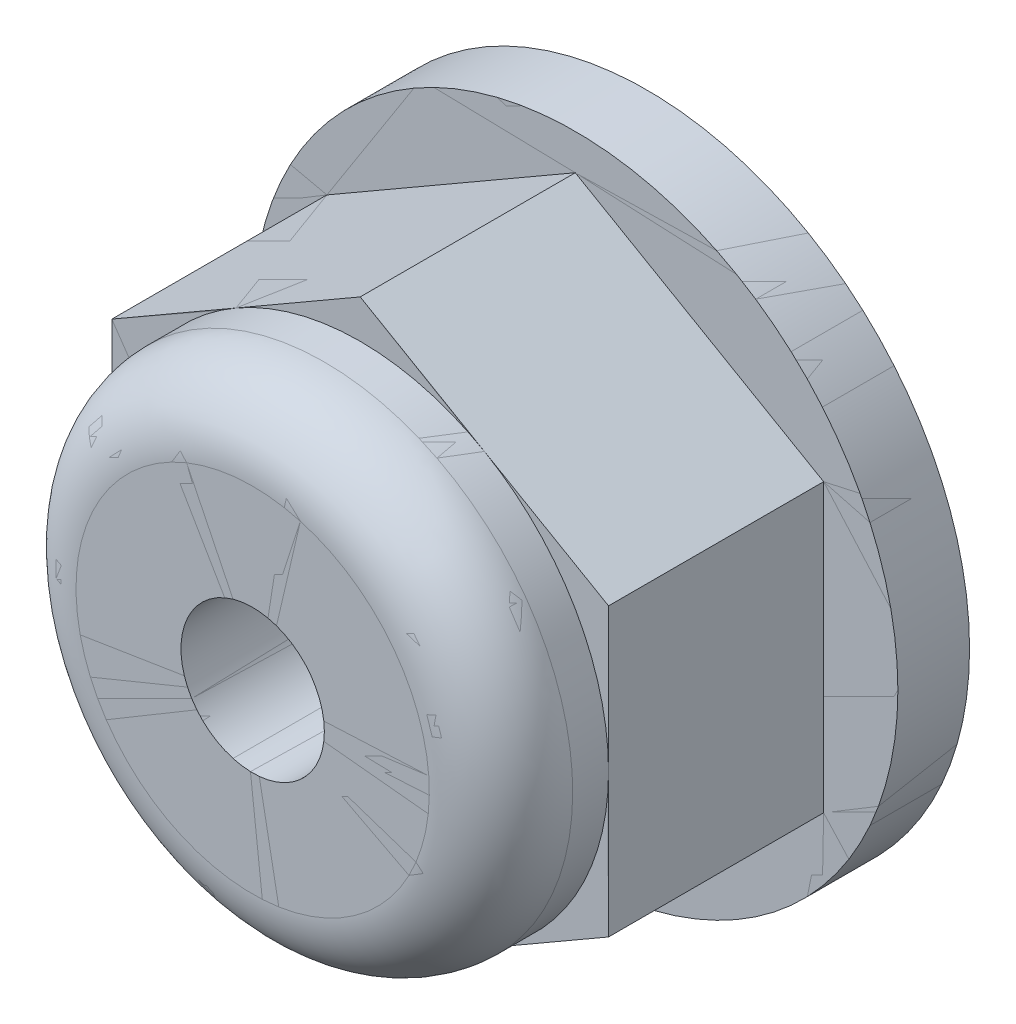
ISO-10303-21;
HEADER;
FILE_DESCRIPTION(('STEP AP214'),'2;1');
FILE_NAME('part.step','',(''),(''),'','','');
FILE_SCHEMA(('AUTOMOTIVE_DESIGN { 1 0 10303 214 1 1 1 1 }'));
ENDSEC;
DATA;
#1=APPLICATION_CONTEXT('core data for automotive mechanical design processes');
#2=APPLICATION_PROTOCOL_DEFINITION('international standard','automotive_design',2000,#1);
#3=PRODUCT_CONTEXT('',#1,'mechanical');
#4=PRODUCT('Part','Part','',(#3));
#5=PRODUCT_RELATED_PRODUCT_CATEGORY('part','',(#4));
#6=PRODUCT_DEFINITION_FORMATION('','',#4);
#7=PRODUCT_DEFINITION_CONTEXT('part definition',#1,'design');
#8=PRODUCT_DEFINITION('design','',#6,#7);
#9=PRODUCT_DEFINITION_SHAPE('','',#8);
#10=(LENGTH_UNIT() NAMED_UNIT(*) SI_UNIT(.MILLI.,.METRE.));
#11=(NAMED_UNIT(*) PLANE_ANGLE_UNIT() SI_UNIT($,.RADIAN.));
#12=(NAMED_UNIT(*) SI_UNIT($,.STERADIAN.) SOLID_ANGLE_UNIT());
#13=UNCERTAINTY_MEASURE_WITH_UNIT(LENGTH_MEASURE(1.E-05),#10,'distance_accuracy_value','');
#14=(GEOMETRIC_REPRESENTATION_CONTEXT(3) GLOBAL_UNCERTAINTY_ASSIGNED_CONTEXT((#13)) GLOBAL_UNIT_ASSIGNED_CONTEXT((#10,
#11,#12)) REPRESENTATION_CONTEXT('',''));
#15=CARTESIAN_POINT('',(0.,0.,0.));
#16=DIRECTION('',(0.,0.,1.));
#17=DIRECTION('',(1.,0.,0.));
#18=AXIS2_PLACEMENT_3D('',#15,#16,#17);
#19=CARTESIAN_POINT('',(-3.36602540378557,-3.36602540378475,4.5));
#20=DIRECTION('',(0.,0.,1.));
#21=DIRECTION('',(1.,0.,0.));
#22=AXIS2_PLACEMENT_3D('',#19,#20,#21);
#23=PLANE('',#22);
#24=CARTESIAN_POINT('',(-4.5026916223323E-13,2.6068036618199E-13,4.5));
#25=DIRECTION('',(0.,0.,1.));
#26=DIRECTION('',(1.,0.,0.));
#27=AXIS2_PLACEMENT_3D('',#24,#25,#26);
#28=CIRCLE('',#27,1.);
#29=CARTESIAN_POINT('',(0.99999999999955,2.6068036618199E-13,4.5));
#30=VERTEX_POINT('',#29);
#31=EDGE_CURVE('P0_E548',#30,#30,#28,.T.);
#32=ORIENTED_EDGE('',*,*,#31,.F.);
#33=EDGE_LOOP('',(#32));
#34=FACE_BOUND('',#33,.T.);
#35=CARTESIAN_POINT('',(-4.5030645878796E-13,2.6068036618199E-13,4.5));
#36=DIRECTION('',(0.,0.,-1.));
#37=DIRECTION('',(0.500000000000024,-0.866025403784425,0.));
#38=AXIS2_PLACEMENT_3D('',#35,#36,#37);
#39=CIRCLE('',#38,2.46410161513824);
#40=CARTESIAN_POINT('',(1.23205080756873,-2.13397459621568,4.5));
#41=VERTEX_POINT('',#40);
#42=EDGE_CURVE('P0_E518',#41,#41,#39,.T.);
#43=ORIENTED_EDGE('',*,*,#42,.F.);
#44=EDGE_LOOP('',(#43));
#45=FACE_BOUND('',#44,.T.);
#46=ADVANCED_FACE('P0_F350',(#34,#45),#23,.T.);
#47=CARTESIAN_POINT('',(1.2320508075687,-2.1339745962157,4.5));
#48=CARTESIAN_POINT('',(1.7320508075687,-3.0000000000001,4.5));
#49=CARTESIAN_POINT('',(1.7320508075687,-3.0000000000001,3.5));
#50=CARTESIAN_POINT('',(1.7320508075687,-3.0000000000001,2.5));
#51=CARTESIAN_POINT('',(1.2320508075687,-2.1339745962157,2.5));
#52=CARTESIAN_POINT('',(0.73205080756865,-1.2679491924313,2.5));
#53=CARTESIAN_POINT('',(0.73205080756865,-1.2679491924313,3.5));
#54=CARTESIAN_POINT('',(0.73205080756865,-1.2679491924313,4.5));
#55=CARTESIAN_POINT('',(1.2320508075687,-2.1339745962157,4.5));
#56=(BOUNDED_CURVE() B_SPLINE_CURVE(2,(#47,#48,#49,#50,#51,#52,#53,#54,#55),.UNSPECIFIED.,.T.,
.F.) B_SPLINE_CURVE_WITH_KNOTS((3,2,2,2,3),(0.,0.25,0.5,0.75,1.),
.UNSPECIFIED.) CURVE() GEOMETRIC_REPRESENTATION_ITEM() RATIONAL_B_SPLINE_CURVE((1.,
0.70710678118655,1.,0.70710678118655,1.,0.70710678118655,1.,0.70710678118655,1.)) REPRESENTATION_ITEM(''));
#57=CARTESIAN_POINT('',(-4.5030645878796E-13,2.6068036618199E-13,2.5));
#58=DIRECTION('',(0.,0.,1.));
#59=AXIS1_PLACEMENT('',#57,#58);
#60=SURFACE_OF_REVOLUTION('',#56,#59);
#61=CARTESIAN_POINT('',(-4.5038809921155E-13,2.6068036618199E-13,3.5));
#62=DIRECTION('',(0.,0.,1.));
#63=DIRECTION('',(0.500000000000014,-0.86602540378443,0.));
#64=AXIS2_PLACEMENT_3D('',#61,#62,#63);
#65=CIRCLE('',#64,3.4641016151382);
#66=CARTESIAN_POINT('',(1.7320508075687,-3.0000000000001,3.5));
#67=VERTEX_POINT('',#66);
#68=EDGE_CURVE('P0_E541',#67,#67,#65,.T.);
#69=ORIENTED_EDGE('',*,*,#68,.T.);
#70=EDGE_LOOP('',(#69));
#71=FACE_BOUND('',#70,.T.);
#72=ORIENTED_EDGE('',*,*,#42,.T.);
#73=EDGE_LOOP('',(#72));
#74=FACE_BOUND('',#73,.T.);
#75=ADVANCED_FACE('P0_F524',(#71,#74),#60,.F.);
#76=CARTESIAN_POINT('',(-4.5026916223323E-13,2.6068036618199E-13,-1.));
#77=DIRECTION('',(0.,0.,1.));
#78=DIRECTION('',(1.,0.,0.));
#79=AXIS2_PLACEMENT_3D('',#76,#77,#78);
#80=CYLINDRICAL_SURFACE('',#79,1.);
#81=CARTESIAN_POINT('',(-4.5026916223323E-13,2.6068036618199E-13,-1.));
#82=DIRECTION('',(0.,0.,1.));
#83=DIRECTION('',(1.,0.,0.));
#84=AXIS2_PLACEMENT_3D('',#81,#82,#83);
#85=CIRCLE('',#84,1.);
#86=CARTESIAN_POINT('',(0.99999999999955,2.6068036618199E-13,-1.));
#87=VERTEX_POINT('',#86);
#88=EDGE_CURVE('P0_E547',#87,#87,#85,.T.);
#89=ORIENTED_EDGE('',*,*,#88,.F.);
#90=EDGE_LOOP('',(#89));
#91=FACE_BOUND('',#90,.T.);
#92=ORIENTED_EDGE('',*,*,#31,.T.);
#93=EDGE_LOOP('',(#92));
#94=FACE_BOUND('',#93,.T.);
#95=ADVANCED_FACE('P0_F534',(#91,#94),#80,.F.);
#96=CARTESIAN_POINT('',(-4.50377582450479E-13,2.60642202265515E-13,3.));
#97=DIRECTION('',(0.,0.,1.));
#98=DIRECTION('',(1.,0.,0.));
#99=AXIS2_PLACEMENT_3D('',#96,#97,#98);
#100=CYLINDRICAL_SURFACE('',#99,3.4641016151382);
#101=CARTESIAN_POINT('',(-4.50377582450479E-13,2.60642202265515E-13,3.));
#102=DIRECTION('',(0.,0.,1.));
#103=DIRECTION('',(1.,0.,0.));
#104=AXIS2_PLACEMENT_3D('',#101,#102,#103);
#105=CIRCLE('',#104,3.4641016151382);
#106=CARTESIAN_POINT('',(1.73205080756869,-3.00000000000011,3.));
#107=VERTEX_POINT('',#106);
#108=CARTESIAN_POINT('',(-1.73205080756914,-3.00000000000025,3.));
#109=VERTEX_POINT('',#108);
#110=EDGE_CURVE('P0_E577',#107,#109,#105,.F.);
#111=ORIENTED_EDGE('',*,*,#110,.F.);
#112=CARTESIAN_POINT('',(-4.50377582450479E-13,2.60642202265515E-13,3.));
#113=DIRECTION('',(0.,0.,1.));
#114=DIRECTION('',(1.,0.,0.));
#115=AXIS2_PLACEMENT_3D('',#112,#113,#114);
#116=CIRCLE('',#115,3.4641016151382);
#117=CARTESIAN_POINT('',(3.46410161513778,2.92523759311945E-13,3.));
#118=VERTEX_POINT('',#117);
#119=EDGE_CURVE('P0_E580',#118,#107,#116,.F.);
#120=ORIENTED_EDGE('',*,*,#119,.F.);
#121=CARTESIAN_POINT('',(-4.50377582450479E-13,2.60642202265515E-13,3.));
#122=DIRECTION('',(0.,0.,1.));
#123=DIRECTION('',(1.,0.,0.));
#124=AXIS2_PLACEMENT_3D('',#121,#122,#123);
#125=CIRCLE('',#124,3.4641016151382);
#126=CARTESIAN_POINT('',(1.73205080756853,3.00000000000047,3.));
#127=VERTEX_POINT('',#126);
#128=EDGE_CURVE('P0_E583',#127,#118,#125,.F.);
#129=ORIENTED_EDGE('',*,*,#128,.F.);
#130=CARTESIAN_POINT('',(-4.50377582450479E-13,2.60642202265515E-13,3.));
#131=DIRECTION('',(0.,0.,1.));
#132=DIRECTION('',(1.,0.,0.));
#133=AXIS2_PLACEMENT_3D('',#130,#131,#132);
#134=CIRCLE('',#133,3.4641016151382);
#135=CARTESIAN_POINT('',(-1.73205080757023,3.00000000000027,3.));
#136=VERTEX_POINT('',#135);
#137=EDGE_CURVE('P0_E410',#136,#127,#134,.F.);
#138=ORIENTED_EDGE('',*,*,#137,.F.);
#139=CARTESIAN_POINT('',(-4.50377582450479E-13,2.60642202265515E-13,3.));
#140=DIRECTION('',(0.,0.,1.));
#141=DIRECTION('',(1.,0.,0.));
#142=AXIS2_PLACEMENT_3D('',#139,#140,#141);
#143=CIRCLE('',#142,3.4641016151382);
#144=CARTESIAN_POINT('',(-3.46410161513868,2.17779946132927E-13,3.));
#145=VERTEX_POINT('',#144);
#146=EDGE_CURVE('P0_E566',#145,#136,#143,.F.);
#147=ORIENTED_EDGE('',*,*,#146,.F.);
#148=CARTESIAN_POINT('',(-4.50377582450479E-13,2.60642202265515E-13,3.));
#149=DIRECTION('',(0.,0.,1.));
#150=DIRECTION('',(1.,0.,0.));
#151=AXIS2_PLACEMENT_3D('',#148,#149,#150);
#152=CIRCLE('',#151,3.4641016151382);
#153=EDGE_CURVE('P0_E434',#109,#145,#152,.F.);
#154=ORIENTED_EDGE('',*,*,#153,.F.);
#155=EDGE_LOOP('',(#111,#120,#129,#138,#147,#154));
#156=FACE_BOUND('',#155,.T.);
#157=ORIENTED_EDGE('',*,*,#68,.F.);
#158=EDGE_LOOP('',(#157));
#159=FACE_BOUND('',#158,.T.);
#160=ADVANCED_FACE('P0_F624',(#156,#159),#100,.T.);
#161=CARTESIAN_POINT('',(4.5,-4.5,-1.));
#162=DIRECTION('',(0.,0.,-1.));
#163=DIRECTION('',(-1.,0.,0.));
#164=AXIS2_PLACEMENT_3D('',#161,#162,#163);
#165=PLANE('',#164);
#166=ORIENTED_EDGE('',*,*,#88,.T.);
#167=EDGE_LOOP('',(#166));
#168=FACE_BOUND('',#167,.T.);
#169=CARTESIAN_POINT('',(0.,0.,-1.));
#170=DIRECTION('',(0.,0.,1.));
#171=DIRECTION('',(1.,0.,0.));
#172=AXIS2_PLACEMENT_3D('',#169,#170,#171);
#173=CIRCLE('',#172,4.5);
#174=CARTESIAN_POINT('',(4.5,0.,-1.));
#175=VERTEX_POINT('',#174);
#176=EDGE_CURVE('P0_E560',#175,#175,#173,.F.);
#177=ORIENTED_EDGE('',*,*,#176,.T.);
#178=EDGE_LOOP('',(#177));
#179=FACE_BOUND('',#178,.T.);
#180=ADVANCED_FACE('P0_F626',(#168,#179),#165,.T.);
#181=CARTESIAN_POINT('',(-3.4641016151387,-4.,3.));
#182=DIRECTION('',(0.,0.,1.));
#183=DIRECTION('',(1.,0.,0.));
#184=AXIS2_PLACEMENT_3D('',#181,#182,#183);
#185=PLANE('',#184);
#186=ORIENTED_EDGE('',*,*,#137,.T.);
#187=DIRECTION('',(0.866025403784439,-0.499999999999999,0.));
#188=VECTOR('',#187,1.);
#189=CARTESIAN_POINT('',(1.73205080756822,3.0000000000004,3.));
#190=LINE('',#189,#188);
#191=CARTESIAN_POINT('',(-6.68026278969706E-10,3.9999999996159,3.));
#192=VERTEX_POINT('',#191);
#193=EDGE_CURVE('P0_E416',#192,#127,#190,.T.);
#194=ORIENTED_EDGE('',*,*,#193,.F.);
#195=DIRECTION('',(0.866025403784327,0.500000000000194,0.));
#196=VECTOR('',#195,1.);
#197=CARTESIAN_POINT('',(-1.73205080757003,3.0000000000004,3.));
#198=LINE('',#197,#196);
#199=EDGE_CURVE('P0_E503',#136,#192,#198,.T.);
#200=ORIENTED_EDGE('',*,*,#199,.F.);
#201=EDGE_LOOP('',(#186,#194,#200));
#202=FACE_BOUND('',#201,.T.);
#203=ADVANCED_FACE('P0_F631',(#202),#185,.T.);
#204=CARTESIAN_POINT('',(-3.4641016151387,-4.,3.));
#205=DIRECTION('',(0.,0.,1.));
#206=DIRECTION('',(1.,0.,0.));
#207=AXIS2_PLACEMENT_3D('',#204,#205,#206);
#208=PLANE('',#207);
#209=DIRECTION('',(0.866025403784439,-0.499999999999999,0.));
#210=VECTOR('',#209,1.);
#211=CARTESIAN_POINT('',(1.73205080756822,3.0000000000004,3.));
#212=LINE('',#211,#210);
#213=CARTESIAN_POINT('',(3.46410161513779,2.,3.));
#214=VERTEX_POINT('',#213);
#215=EDGE_CURVE('P0_E493',#127,#214,#212,.T.);
#216=ORIENTED_EDGE('',*,*,#215,.F.);
#217=ORIENTED_EDGE('',*,*,#128,.T.);
#218=DIRECTION('',(0.,-1.,0.));
#219=VECTOR('',#218,1.);
#220=CARTESIAN_POINT('',(3.4641016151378,0.,3.));
#221=LINE('',#220,#219);
#222=EDGE_CURVE('P0_E481',#214,#118,#221,.T.);
#223=ORIENTED_EDGE('',*,*,#222,.F.);
#224=EDGE_LOOP('',(#216,#217,#223));
#225=FACE_BOUND('',#224,.T.);
#226=ADVANCED_FACE('P0_F654',(#225),#208,.T.);
#227=CARTESIAN_POINT('',(-3.4641016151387,-4.,3.));
#228=DIRECTION('',(0.,0.,1.));
#229=DIRECTION('',(1.,0.,0.));
#230=AXIS2_PLACEMENT_3D('',#227,#228,#229);
#231=PLANE('',#230);
#232=DIRECTION('',(0.,-1.,0.));
#233=VECTOR('',#232,1.);
#234=CARTESIAN_POINT('',(3.4641016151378,0.,3.));
#235=LINE('',#234,#233);
#236=CARTESIAN_POINT('',(3.4641016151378,-1.99999999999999,3.));
#237=VERTEX_POINT('',#236);
#238=EDGE_CURVE('P0_E478',#118,#237,#235,.T.);
#239=ORIENTED_EDGE('',*,*,#238,.F.);
#240=ORIENTED_EDGE('',*,*,#119,.T.);
#241=DIRECTION('',(-0.866025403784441,-0.499999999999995,0.));
#242=VECTOR('',#241,1.);
#243=CARTESIAN_POINT('',(1.7320508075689,-3.,3.));
#244=LINE('',#243,#242);
#245=EDGE_CURVE('P0_E467',#237,#107,#244,.T.);
#246=ORIENTED_EDGE('',*,*,#245,.F.);
#247=EDGE_LOOP('',(#239,#240,#246));
#248=FACE_BOUND('',#247,.T.);
#249=ADVANCED_FACE('P0_F640',(#248),#231,.T.);
#250=CARTESIAN_POINT('',(-3.4641016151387,-4.,3.));
#251=DIRECTION('',(0.,0.,1.));
#252=DIRECTION('',(1.,0.,0.));
#253=AXIS2_PLACEMENT_3D('',#250,#251,#252);
#254=PLANE('',#253);
#255=DIRECTION('',(-0.866025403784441,-0.499999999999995,0.));
#256=VECTOR('',#255,1.);
#257=CARTESIAN_POINT('',(1.7320508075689,-3.,3.));
#258=LINE('',#257,#256);
#259=CARTESIAN_POINT('',(6.66662760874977E-10,-3.9999999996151,3.));
#260=VERTEX_POINT('',#259);
#261=EDGE_CURVE('P0_E464',#107,#260,#258,.T.);
#262=ORIENTED_EDGE('',*,*,#261,.F.);
#263=ORIENTED_EDGE('',*,*,#110,.T.);
#264=DIRECTION('',(-0.866025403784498,0.499999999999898,0.));
#265=VECTOR('',#264,1.);
#266=CARTESIAN_POINT('',(-1.73205080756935,-3.,3.));
#267=LINE('',#266,#265);
#268=EDGE_CURVE('P0_E443',#260,#109,#267,.T.);
#269=ORIENTED_EDGE('',*,*,#268,.F.);
#270=EDGE_LOOP('',(#262,#263,#269));
#271=FACE_BOUND('',#270,.T.);
#272=ADVANCED_FACE('P0_F641',(#271),#254,.T.);
#273=CARTESIAN_POINT('',(-3.4641016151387,-4.,3.));
#274=DIRECTION('',(0.,0.,1.));
#275=DIRECTION('',(1.,0.,0.));
#276=AXIS2_PLACEMENT_3D('',#273,#274,#275);
#277=PLANE('',#276);
#278=DIRECTION('',(-0.866025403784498,0.499999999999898,0.));
#279=VECTOR('',#278,1.);
#280=CARTESIAN_POINT('',(-1.73205080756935,-3.,3.));
#281=LINE('',#280,#279);
#282=CARTESIAN_POINT('',(-3.4641016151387,-2.,3.));
#283=VERTEX_POINT('',#282);
#284=EDGE_CURVE('P0_E432',#109,#283,#281,.T.);
#285=ORIENTED_EDGE('',*,*,#284,.F.);
#286=ORIENTED_EDGE('',*,*,#153,.T.);
#287=DIRECTION('',(0.,1.,0.));
#288=VECTOR('',#287,1.);
#289=CARTESIAN_POINT('',(-3.4641016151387,0.,3.));
#290=LINE('',#289,#288);
#291=EDGE_CURVE('P0_E430',#283,#145,#290,.T.);
#292=ORIENTED_EDGE('',*,*,#291,.F.);
#293=EDGE_LOOP('',(#285,#286,#292));
#294=FACE_BOUND('',#293,.T.);
#295=ADVANCED_FACE('P0_F431',(#294),#277,.T.);
#296=CARTESIAN_POINT('',(-3.4641016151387,-4.,3.));
#297=DIRECTION('',(0.,0.,1.));
#298=DIRECTION('',(1.,0.,0.));
#299=AXIS2_PLACEMENT_3D('',#296,#297,#298);
#300=PLANE('',#299);
#301=DIRECTION('',(0.,1.,0.));
#302=VECTOR('',#301,1.);
#303=CARTESIAN_POINT('',(-3.4641016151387,0.,3.));
#304=LINE('',#303,#302);
#305=CARTESIAN_POINT('',(-3.4641016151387,2.,3.));
#306=VERTEX_POINT('',#305);
#307=EDGE_CURVE('P0_E438',#145,#306,#304,.T.);
#308=ORIENTED_EDGE('',*,*,#307,.F.);
#309=ORIENTED_EDGE('',*,*,#146,.T.);
#310=DIRECTION('',(0.866025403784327,0.500000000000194,0.));
#311=VECTOR('',#310,1.);
#312=CARTESIAN_POINT('',(-1.73205080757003,3.0000000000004,3.));
#313=LINE('',#312,#311);
#314=EDGE_CURVE('P0_E507',#306,#136,#313,.T.);
#315=ORIENTED_EDGE('',*,*,#314,.F.);
#316=EDGE_LOOP('',(#308,#309,#315));
#317=FACE_BOUND('',#316,.T.);
#318=ADVANCED_FACE('P0_F614',(#317),#300,.T.);
#319=CARTESIAN_POINT('',(0.,0.,-1.));
#320=DIRECTION('',(0.,0.,1.));
#321=DIRECTION('',(1.,0.,0.));
#322=AXIS2_PLACEMENT_3D('',#319,#320,#321);
#323=CYLINDRICAL_SURFACE('',#322,4.5);
#324=ORIENTED_EDGE('',*,*,#176,.F.);
#325=EDGE_LOOP('',(#324));
#326=FACE_BOUND('',#325,.T.);
#327=CARTESIAN_POINT('',(0.,0.,0.));
#328=DIRECTION('',(0.,0.,1.));
#329=DIRECTION('',(1.,0.,0.));
#330=AXIS2_PLACEMENT_3D('',#327,#328,#329);
#331=CIRCLE('',#330,4.5);
#332=CARTESIAN_POINT('',(4.5,0.,0.));
#333=VERTEX_POINT('',#332);
#334=EDGE_CURVE('P0_E448',#333,#333,#331,.T.);
#335=ORIENTED_EDGE('',*,*,#334,.F.);
#336=EDGE_LOOP('',(#335));
#337=FACE_BOUND('',#336,.T.);
#338=ADVANCED_FACE('P0_F611',(#326,#337),#323,.T.);
#339=CARTESIAN_POINT('',(-1.3531855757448E-12,4.0000000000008,3.));
#340=DIRECTION('',(-0.500000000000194,0.866025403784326,0.));
#341=DIRECTION('',(0.,0.,-1.));
#342=AXIS2_PLACEMENT_3D('',#339,#340,#341);
#343=PLANE('',#342);
#344=DIRECTION('',(0.866025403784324,0.500000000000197,0.));
#345=VECTOR('',#344,1.);
#346=CARTESIAN_POINT('',(-3.46410161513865,1.99999999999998,0.));
#347=LINE('',#346,#345);
#348=CARTESIAN_POINT('',(-3.46410161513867,1.99999999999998,0.));
#349=VERTEX_POINT('',#348);
#350=CARTESIAN_POINT('',(-1.3547151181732E-12,4.00000000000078,0.));
#351=VERTEX_POINT('',#350);
#352=EDGE_CURVE('P0_E452',#349,#351,#347,.T.);
#353=ORIENTED_EDGE('',*,*,#352,.F.);
#354=DIRECTION('',(0.,0.,-1.));
#355=VECTOR('',#354,1.);
#356=CARTESIAN_POINT('',(-3.4641016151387,2.,1.));
#357=LINE('',#356,#355);
#358=EDGE_CURVE('P0_E449',#306,#349,#357,.T.);
#359=ORIENTED_EDGE('',*,*,#358,.F.);
#360=ORIENTED_EDGE('',*,*,#314,.T.);
#361=ORIENTED_EDGE('',*,*,#199,.T.);
#362=DIRECTION('',(0.,0.,1.));
#363=VECTOR('',#362,1.);
#364=CARTESIAN_POINT('',(-1.3540280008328E-12,4.0000000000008,0.9999999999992));
#365=LINE('',#364,#363);
#366=EDGE_CURVE('P0_E490',#351,#192,#365,.T.);
#367=ORIENTED_EDGE('',*,*,#366,.F.);
#368=EDGE_LOOP('',(#353,#359,#360,#361,#367));
#369=FACE_BOUND('',#368,.T.);
#370=ADVANCED_FACE('P0_F613',(#369),#343,.T.);
#371=CARTESIAN_POINT('',(3.4641016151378,2.,3.));
#372=DIRECTION('',(0.499999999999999,0.866025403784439,0.));
#373=DIRECTION('',(0.,0.,-1.));
#374=AXIS2_PLACEMENT_3D('',#371,#372,#373);
#375=PLANE('',#374);
#376=DIRECTION('',(0.866025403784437,-0.500000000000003,0.));
#377=VECTOR('',#376,1.);
#378=CARTESIAN_POINT('',(-1.34874750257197E-12,4.00000000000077,0.));
#379=LINE('',#378,#377);
#380=CARTESIAN_POINT('',(3.46410161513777,1.99999999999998,0.));
#381=VERTEX_POINT('',#380);
#382=EDGE_CURVE('P0_E657',#351,#381,#379,.T.);
#383=ORIENTED_EDGE('',*,*,#382,.F.);
#384=ORIENTED_EDGE('',*,*,#366,.T.);
#385=ORIENTED_EDGE('',*,*,#193,.T.);
#386=ORIENTED_EDGE('',*,*,#215,.T.);
#387=DIRECTION('',(0.,0.,1.));
#388=VECTOR('',#387,1.);
#389=CARTESIAN_POINT('',(3.4641016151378,2.,1.));
#390=LINE('',#389,#388);
#391=EDGE_CURVE('P0_E475',#381,#214,#390,.T.);
#392=ORIENTED_EDGE('',*,*,#391,.F.);
#393=EDGE_LOOP('',(#383,#384,#385,#386,#392));
#394=FACE_BOUND('',#393,.T.);
#395=ADVANCED_FACE('P0_F620',(#394),#375,.T.);
#396=CARTESIAN_POINT('',(3.4641016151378,-2.,3.));
#397=DIRECTION('',(1.,0.,0.));
#398=DIRECTION('',(0.,0.,-1.));
#399=AXIS2_PLACEMENT_3D('',#396,#397,#398);
#400=PLANE('',#399);
#401=DIRECTION('',(0.,-1.,0.));
#402=VECTOR('',#401,1.);
#403=CARTESIAN_POINT('',(3.46410161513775,0.,0.));
#404=LINE('',#403,#402);
#405=CARTESIAN_POINT('',(3.46410161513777,-1.99999999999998,0.));
#406=VERTEX_POINT('',#405);
#407=EDGE_CURVE('P0_E650',#381,#406,#404,.T.);
#408=ORIENTED_EDGE('',*,*,#407,.F.);
#409=ORIENTED_EDGE('',*,*,#391,.T.);
#410=ORIENTED_EDGE('',*,*,#222,.T.);
#411=ORIENTED_EDGE('',*,*,#238,.T.);
#412=DIRECTION('',(0.,0.,1.));
#413=VECTOR('',#412,1.);
#414=CARTESIAN_POINT('',(3.4641016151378,-2.,1.));
#415=LINE('',#414,#413);
#416=EDGE_CURVE('P0_E461',#406,#237,#415,.T.);
#417=ORIENTED_EDGE('',*,*,#416,.F.);
#418=EDGE_LOOP('',(#408,#409,#410,#411,#417));
#419=FACE_BOUND('',#418,.T.);
#420=ADVANCED_FACE('P0_F649',(#419),#400,.T.);
#421=CARTESIAN_POINT('',(0.,-4.,3.));
#422=DIRECTION('',(0.499999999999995,-0.866025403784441,0.));
#423=DIRECTION('',(0.,0.,-1.));
#424=AXIS2_PLACEMENT_3D('',#421,#422,#423);
#425=PLANE('',#424);
#426=DIRECTION('',(-0.866025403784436,-0.500000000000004,0.));
#427=VECTOR('',#426,1.);
#428=CARTESIAN_POINT('',(3.46410161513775,-1.99999999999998,0.));
#429=LINE('',#428,#427);
#430=CARTESIAN_POINT('',(0.,-4.,0.));
#431=VERTEX_POINT('',#430);
#432=EDGE_CURVE('P0_E645',#406,#431,#429,.T.);
#433=ORIENTED_EDGE('',*,*,#432,.F.);
#434=ORIENTED_EDGE('',*,*,#416,.T.);
#435=ORIENTED_EDGE('',*,*,#245,.T.);
#436=ORIENTED_EDGE('',*,*,#261,.T.);
#437=DIRECTION('',(0.,0.,1.));
#438=VECTOR('',#437,1.);
#439=CARTESIAN_POINT('',(0.,-4.,0.9999999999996));
#440=LINE('',#439,#438);
#441=EDGE_CURVE('P0_E439',#431,#260,#440,.T.);
#442=ORIENTED_EDGE('',*,*,#441,.F.);
#443=EDGE_LOOP('',(#433,#434,#435,#436,#442));
#444=FACE_BOUND('',#443,.T.);
#445=ADVANCED_FACE('P0_F644',(#444),#425,.T.);
#446=CARTESIAN_POINT('',(-3.4641016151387,-2.,3.));
#447=DIRECTION('',(-0.499999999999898,-0.866025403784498,0.));
#448=DIRECTION('',(0.,0.,-1.));
#449=AXIS2_PLACEMENT_3D('',#446,#447,#448);
#450=PLANE('',#449);
#451=DIRECTION('',(-0.866025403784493,0.499999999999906,0.));
#452=VECTOR('',#451,1.);
#453=CARTESIAN_POINT('',(0.,-4.,0.));
#454=LINE('',#453,#452);
#455=CARTESIAN_POINT('',(-3.46410161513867,-1.99999999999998,0.));
#456=VERTEX_POINT('',#455);
#457=EDGE_CURVE('P0_E360',#431,#456,#454,.T.);
#458=ORIENTED_EDGE('',*,*,#457,.F.);
#459=ORIENTED_EDGE('',*,*,#441,.T.);
#460=ORIENTED_EDGE('',*,*,#268,.T.);
#461=ORIENTED_EDGE('',*,*,#284,.T.);
#462=DIRECTION('',(0.,0.,1.));
#463=VECTOR('',#462,1.);
#464=CARTESIAN_POINT('',(-3.4641016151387,-2.,1.));
#465=LINE('',#464,#463);
#466=EDGE_CURVE('P0_E369',#456,#283,#465,.T.);
#467=ORIENTED_EDGE('',*,*,#466,.F.);
#468=EDGE_LOOP('',(#458,#459,#460,#461,#467));
#469=FACE_BOUND('',#468,.T.);
#470=ADVANCED_FACE('P0_F441',(#469),#450,.T.);
#471=CARTESIAN_POINT('',(-3.4641016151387,2.,3.));
#472=DIRECTION('',(-1.,0.,0.));
#473=DIRECTION('',(0.,0.,-1.));
#474=AXIS2_PLACEMENT_3D('',#471,#472,#473);
#475=PLANE('',#474);
#476=DIRECTION('',(0.,1.,0.));
#477=VECTOR('',#476,1.);
#478=CARTESIAN_POINT('',(-3.46410161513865,0.,0.));
#479=LINE('',#478,#477);
#480=EDGE_CURVE('P0_E11',#456,#349,#479,.T.);
#481=ORIENTED_EDGE('',*,*,#480,.F.);
#482=ORIENTED_EDGE('',*,*,#466,.T.);
#483=ORIENTED_EDGE('',*,*,#291,.T.);
#484=ORIENTED_EDGE('',*,*,#307,.T.);
#485=ORIENTED_EDGE('',*,*,#358,.T.);
#486=EDGE_LOOP('',(#481,#482,#483,#484,#485));
#487=FACE_BOUND('',#486,.T.);
#488=ADVANCED_FACE('P0_F445',(#487),#475,.T.);
#489=CARTESIAN_POINT('',(-4.5,-4.5,0.));
#490=DIRECTION('',(0.,0.,1.));
#491=DIRECTION('',(1.,0.,0.));
#492=AXIS2_PLACEMENT_3D('',#489,#490,#491);
#493=PLANE('',#492);
#494=ORIENTED_EDGE('',*,*,#457,.T.);
#495=ORIENTED_EDGE('',*,*,#480,.T.);
#496=ORIENTED_EDGE('',*,*,#352,.T.);
#497=ORIENTED_EDGE('',*,*,#382,.T.);
#498=ORIENTED_EDGE('',*,*,#407,.T.);
#499=ORIENTED_EDGE('',*,*,#432,.T.);
#500=EDGE_LOOP('',(#494,#495,#496,#497,#498,#499));
#501=FACE_BOUND('',#500,.T.);
#502=ORIENTED_EDGE('',*,*,#334,.T.);
#503=EDGE_LOOP('',(#502));
#504=FACE_BOUND('',#503,.T.);
#505=ADVANCED_FACE('P0_F352',(#501,#504),#493,.T.);
#506=CLOSED_SHELL('',(#46,#75,#95,#160,#180,#203,#226,#249,#272,#295,#318,#338,#370,#395,#420,
#445,#470,#488,#505));
#507=MANIFOLD_SOLID_BREP('P0_B2',#506);
#508=CARTESIAN_POINT('',(-3.36602540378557,-3.36602540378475,4.5));
#509=DIRECTION('',(0.,0.,1.));
#510=DIRECTION('',(1.,0.,0.));
#511=AXIS2_PLACEMENT_3D('',#508,#509,#510);
#512=PLANE('',#511);
#513=CARTESIAN_POINT('',(-4.5026916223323E-13,2.6068036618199E-13,4.5));
#514=DIRECTION('',(0.,0.,1.));
#515=DIRECTION('',(1.,0.,0.));
#516=AXIS2_PLACEMENT_3D('',#513,#514,#515);
#517=CIRCLE('',#516,1.);
#518=CARTESIAN_POINT('',(0.99999999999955,2.6068036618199E-13,4.5));
#519=VERTEX_POINT('',#518);
#520=EDGE_CURVE('P1_E213',#519,#519,#517,.T.);
#521=ORIENTED_EDGE('',*,*,#520,.F.);
#522=EDGE_LOOP('',(#521));
#523=FACE_BOUND('',#522,.T.);
#524=CARTESIAN_POINT('',(-4.5030645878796E-13,2.6068036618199E-13,4.5));
#525=DIRECTION('',(0.,0.,-1.));
#526=DIRECTION('',(0.500000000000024,-0.866025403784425,0.));
#527=AXIS2_PLACEMENT_3D('',#524,#525,#526);
#528=CIRCLE('',#527,2.46410161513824);
#529=CARTESIAN_POINT('',(1.23205080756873,-2.13397459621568,4.5));
#530=VERTEX_POINT('',#529);
#531=EDGE_CURVE('P1_E184',#530,#530,#528,.T.);
#532=ORIENTED_EDGE('',*,*,#531,.F.);
#533=EDGE_LOOP('',(#532));
#534=FACE_BOUND('',#533,.T.);
#535=ADVANCED_FACE('P1_F16',(#523,#534),#512,.T.);
#536=CARTESIAN_POINT('',(1.2320508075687,-2.1339745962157,4.5));
#537=CARTESIAN_POINT('',(1.7320508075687,-3.0000000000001,4.5));
#538=CARTESIAN_POINT('',(1.7320508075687,-3.0000000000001,3.5));
#539=CARTESIAN_POINT('',(1.7320508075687,-3.0000000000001,2.5));
#540=CARTESIAN_POINT('',(1.2320508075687,-2.1339745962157,2.5));
#541=CARTESIAN_POINT('',(0.73205080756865,-1.2679491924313,2.5));
#542=CARTESIAN_POINT('',(0.73205080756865,-1.2679491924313,3.5));
#543=CARTESIAN_POINT('',(0.73205080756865,-1.2679491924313,4.5));
#544=CARTESIAN_POINT('',(1.2320508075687,-2.1339745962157,4.5));
#545=(BOUNDED_CURVE() B_SPLINE_CURVE(2,(#536,#537,#538,#539,#540,#541,#542,#543,#544),
.UNSPECIFIED.,.T.,.F.) B_SPLINE_CURVE_WITH_KNOTS((3,2,2,2,3),(0.,0.25,0.5,0.75,1.),
.UNSPECIFIED.) CURVE() GEOMETRIC_REPRESENTATION_ITEM() RATIONAL_B_SPLINE_CURVE((1.,
0.70710678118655,1.,0.70710678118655,1.,0.70710678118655,1.,0.70710678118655,1.)) REPRESENTATION_ITEM(''));
#546=CARTESIAN_POINT('',(-4.5030645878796E-13,2.6068036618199E-13,2.5));
#547=DIRECTION('',(0.,0.,1.));
#548=AXIS1_PLACEMENT('',#546,#547);
#549=SURFACE_OF_REVOLUTION('',#545,#548);
#550=CARTESIAN_POINT('',(-4.5038809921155E-13,2.6068036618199E-13,3.5));
#551=DIRECTION('',(0.,0.,1.));
#552=DIRECTION('',(0.500000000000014,-0.86602540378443,0.));
#553=AXIS2_PLACEMENT_3D('',#550,#551,#552);
#554=CIRCLE('',#553,3.4641016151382);
#555=CARTESIAN_POINT('',(1.7320508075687,-3.0000000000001,3.5));
#556=VERTEX_POINT('',#555);
#557=EDGE_CURVE('P1_E206',#556,#556,#554,.T.);
#558=ORIENTED_EDGE('',*,*,#557,.T.);
#559=EDGE_LOOP('',(#558));
#560=FACE_BOUND('',#559,.T.);
#561=ORIENTED_EDGE('',*,*,#531,.T.);
#562=EDGE_LOOP('',(#561));
#563=FACE_BOUND('',#562,.T.);
#564=ADVANCED_FACE('P1_F190',(#560,#563),#549,.F.);
#565=CARTESIAN_POINT('',(-4.5026916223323E-13,2.6068036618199E-13,-1.));
#566=DIRECTION('',(0.,0.,1.));
#567=DIRECTION('',(1.,0.,0.));
#568=AXIS2_PLACEMENT_3D('',#565,#566,#567);
#569=CYLINDRICAL_SURFACE('',#568,1.);
#570=CARTESIAN_POINT('',(-4.5026916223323E-13,2.6068036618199E-13,-1.));
#571=DIRECTION('',(0.,0.,1.));
#572=DIRECTION('',(1.,0.,0.));
#573=AXIS2_PLACEMENT_3D('',#570,#571,#572);
#574=CIRCLE('',#573,1.);
#575=CARTESIAN_POINT('',(0.99999999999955,2.6068036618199E-13,-1.));
#576=VERTEX_POINT('',#575);
#577=EDGE_CURVE('P1_E212',#576,#576,#574,.T.);
#578=ORIENTED_EDGE('',*,*,#577,.F.);
#579=EDGE_LOOP('',(#578));
#580=FACE_BOUND('',#579,.T.);
#581=ORIENTED_EDGE('',*,*,#520,.T.);
#582=EDGE_LOOP('',(#581));
#583=FACE_BOUND('',#582,.T.);
#584=ADVANCED_FACE('P1_F199',(#580,#583),#569,.F.);
#585=CARTESIAN_POINT('',(-4.50377582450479E-13,2.60642202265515E-13,3.));
#586=DIRECTION('',(0.,0.,1.));
#587=DIRECTION('',(1.,0.,0.));
#588=AXIS2_PLACEMENT_3D('',#585,#586,#587);
#589=CYLINDRICAL_SURFACE('',#588,3.4641016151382);
#590=CARTESIAN_POINT('',(-4.50377582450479E-13,2.60642202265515E-13,3.));
#591=DIRECTION('',(0.,0.,1.));
#592=DIRECTION('',(1.,0.,0.));
#593=AXIS2_PLACEMENT_3D('',#590,#591,#592);
#594=CIRCLE('',#593,3.4641016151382);
#595=CARTESIAN_POINT('',(1.73205080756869,-3.00000000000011,3.));
#596=VERTEX_POINT('',#595);
#597=CARTESIAN_POINT('',(-1.73205080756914,-3.00000000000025,3.));
#598=VERTEX_POINT('',#597);
#599=EDGE_CURVE('P1_E242',#596,#598,#594,.F.);
#600=ORIENTED_EDGE('',*,*,#599,.F.);
#601=CARTESIAN_POINT('',(-4.50377582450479E-13,2.60642202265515E-13,3.));
#602=DIRECTION('',(0.,0.,1.));
#603=DIRECTION('',(1.,0.,0.));
#604=AXIS2_PLACEMENT_3D('',#601,#602,#603);
#605=CIRCLE('',#604,3.4641016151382);
#606=CARTESIAN_POINT('',(3.46410161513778,2.92523759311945E-13,3.));
#607=VERTEX_POINT('',#606);
#608=EDGE_CURVE('P1_E245',#607,#596,#605,.F.);
#609=ORIENTED_EDGE('',*,*,#608,.F.);
#610=CARTESIAN_POINT('',(-4.50377582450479E-13,2.60642202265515E-13,3.));
#611=DIRECTION('',(0.,0.,1.));
#612=DIRECTION('',(1.,0.,0.));
#613=AXIS2_PLACEMENT_3D('',#610,#611,#612);
#614=CIRCLE('',#613,3.4641016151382);
#615=CARTESIAN_POINT('',(1.73205080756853,3.00000000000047,3.));
#616=VERTEX_POINT('',#615);
#617=EDGE_CURVE('P1_E248',#616,#607,#614,.F.);
#618=ORIENTED_EDGE('',*,*,#617,.F.);
#619=CARTESIAN_POINT('',(-4.50377582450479E-13,2.60642202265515E-13,3.));
#620=DIRECTION('',(0.,0.,1.));
#621=DIRECTION('',(1.,0.,0.));
#622=AXIS2_PLACEMENT_3D('',#619,#620,#621);
#623=CIRCLE('',#622,3.4641016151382);
#624=CARTESIAN_POINT('',(-1.73205080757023,3.00000000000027,3.));
#625=VERTEX_POINT('',#624);
#626=EDGE_CURVE('P1_E76',#625,#616,#623,.F.);
#627=ORIENTED_EDGE('',*,*,#626,.F.);
#628=CARTESIAN_POINT('',(-4.50377582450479E-13,2.60642202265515E-13,3.));
#629=DIRECTION('',(0.,0.,1.));
#630=DIRECTION('',(1.,0.,0.));
#631=AXIS2_PLACEMENT_3D('',#628,#629,#630);
#632=CIRCLE('',#631,3.4641016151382);
#633=CARTESIAN_POINT('',(-3.46410161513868,2.17779946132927E-13,3.));
#634=VERTEX_POINT('',#633);
#635=EDGE_CURVE('P1_E231',#634,#625,#632,.F.);
#636=ORIENTED_EDGE('',*,*,#635,.F.);
#637=CARTESIAN_POINT('',(-4.50377582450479E-13,2.60642202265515E-13,3.));
#638=DIRECTION('',(0.,0.,1.));
#639=DIRECTION('',(1.,0.,0.));
#640=AXIS2_PLACEMENT_3D('',#637,#638,#639);
#641=CIRCLE('',#640,3.4641016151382);
#642=EDGE_CURVE('P1_E100',#598,#634,#641,.F.);
#643=ORIENTED_EDGE('',*,*,#642,.F.);
#644=EDGE_LOOP('',(#600,#609,#618,#627,#636,#643));
#645=FACE_BOUND('',#644,.T.);
#646=ORIENTED_EDGE('',*,*,#557,.F.);
#647=EDGE_LOOP('',(#646));
#648=FACE_BOUND('',#647,.T.);
#649=ADVANCED_FACE('P1_F277',(#645,#648),#589,.T.);
#650=CARTESIAN_POINT('',(4.5,-4.5,-1.));
#651=DIRECTION('',(0.,0.,-1.));
#652=DIRECTION('',(-1.,0.,0.));
#653=AXIS2_PLACEMENT_3D('',#650,#651,#652);
#654=PLANE('',#653);
#655=ORIENTED_EDGE('',*,*,#577,.T.);
#656=EDGE_LOOP('',(#655));
#657=FACE_BOUND('',#656,.T.);
#658=CARTESIAN_POINT('',(0.,0.,-1.));
#659=DIRECTION('',(0.,0.,1.));
#660=DIRECTION('',(1.,0.,0.));
#661=AXIS2_PLACEMENT_3D('',#658,#659,#660);
#662=CIRCLE('',#661,4.5);
#663=CARTESIAN_POINT('',(4.5,0.,-1.));
#664=VERTEX_POINT('',#663);
#665=EDGE_CURVE('P1_E225',#664,#664,#662,.F.);
#666=ORIENTED_EDGE('',*,*,#665,.T.);
#667=EDGE_LOOP('',(#666));
#668=FACE_BOUND('',#667,.T.);
#669=ADVANCED_FACE('P1_F278',(#657,#668),#654,.T.);
#670=CARTESIAN_POINT('',(-3.4641016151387,-4.,3.));
#671=DIRECTION('',(0.,0.,1.));
#672=DIRECTION('',(1.,0.,0.));
#673=AXIS2_PLACEMENT_3D('',#670,#671,#672);
#674=PLANE('',#673);
#675=ORIENTED_EDGE('',*,*,#626,.T.);
#676=DIRECTION('',(0.866025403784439,-0.499999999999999,0.));
#677=VECTOR('',#676,1.);
#678=CARTESIAN_POINT('',(1.73205080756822,3.0000000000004,3.));
#679=LINE('',#678,#677);
#680=CARTESIAN_POINT('',(-6.68026278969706E-10,3.9999999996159,3.));
#681=VERTEX_POINT('',#680);
#682=EDGE_CURVE('P1_E82',#681,#616,#679,.T.);
#683=ORIENTED_EDGE('',*,*,#682,.F.);
#684=DIRECTION('',(0.866025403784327,0.500000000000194,0.));
#685=VECTOR('',#684,1.);
#686=CARTESIAN_POINT('',(-1.73205080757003,3.0000000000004,3.));
#687=LINE('',#686,#685);
#688=EDGE_CURVE('P1_E169',#625,#681,#687,.T.);
#689=ORIENTED_EDGE('',*,*,#688,.F.);
#690=EDGE_LOOP('',(#675,#683,#689));
#691=FACE_BOUND('',#690,.T.);
#692=ADVANCED_FACE('P1_F279',(#691),#674,.T.);
#693=CARTESIAN_POINT('',(-3.4641016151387,-4.,3.));
#694=DIRECTION('',(0.,0.,1.));
#695=DIRECTION('',(1.,0.,0.));
#696=AXIS2_PLACEMENT_3D('',#693,#694,#695);
#697=PLANE('',#696);
#698=DIRECTION('',(0.866025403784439,-0.499999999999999,0.));
#699=VECTOR('',#698,1.);
#700=CARTESIAN_POINT('',(1.73205080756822,3.0000000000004,3.));
#701=LINE('',#700,#699);
#702=CARTESIAN_POINT('',(3.46410161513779,2.,3.));
#703=VERTEX_POINT('',#702);
#704=EDGE_CURVE('P1_E159',#616,#703,#701,.T.);
#705=ORIENTED_EDGE('',*,*,#704,.F.);
#706=ORIENTED_EDGE('',*,*,#617,.T.);
#707=DIRECTION('',(0.,-1.,0.));
#708=VECTOR('',#707,1.);
#709=CARTESIAN_POINT('',(3.4641016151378,0.,3.));
#710=LINE('',#709,#708);
#711=EDGE_CURVE('P1_E147',#703,#607,#710,.T.);
#712=ORIENTED_EDGE('',*,*,#711,.F.);
#713=EDGE_LOOP('',(#705,#706,#712));
#714=FACE_BOUND('',#713,.T.);
#715=ADVANCED_FACE('P1_F302',(#714),#697,.T.);
#716=CARTESIAN_POINT('',(-3.4641016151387,-4.,3.));
#717=DIRECTION('',(0.,0.,1.));
#718=DIRECTION('',(1.,0.,0.));
#719=AXIS2_PLACEMENT_3D('',#716,#717,#718);
#720=PLANE('',#719);
#721=DIRECTION('',(0.,-1.,0.));
#722=VECTOR('',#721,1.);
#723=CARTESIAN_POINT('',(3.4641016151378,0.,3.));
#724=LINE('',#723,#722);
#725=CARTESIAN_POINT('',(3.4641016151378,-1.99999999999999,3.));
#726=VERTEX_POINT('',#725);
#727=EDGE_CURVE('P1_E144',#607,#726,#724,.T.);
#728=ORIENTED_EDGE('',*,*,#727,.F.);
#729=ORIENTED_EDGE('',*,*,#608,.T.);
#730=DIRECTION('',(-0.866025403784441,-0.499999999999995,0.));
#731=VECTOR('',#730,1.);
#732=CARTESIAN_POINT('',(1.7320508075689,-3.,3.));
#733=LINE('',#732,#731);
#734=EDGE_CURVE('P1_E133',#726,#596,#733,.T.);
#735=ORIENTED_EDGE('',*,*,#734,.F.);
#736=EDGE_LOOP('',(#728,#729,#735));
#737=FACE_BOUND('',#736,.T.);
#738=ADVANCED_FACE('P1_F288',(#737),#720,.T.);
#739=CARTESIAN_POINT('',(-3.4641016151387,-4.,3.));
#740=DIRECTION('',(0.,0.,1.));
#741=DIRECTION('',(1.,0.,0.));
#742=AXIS2_PLACEMENT_3D('',#739,#740,#741);
#743=PLANE('',#742);
#744=DIRECTION('',(-0.866025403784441,-0.499999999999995,0.));
#745=VECTOR('',#744,1.);
#746=CARTESIAN_POINT('',(1.7320508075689,-3.,3.));
#747=LINE('',#746,#745);
#748=CARTESIAN_POINT('',(6.66662760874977E-10,-3.9999999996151,3.));
#749=VERTEX_POINT('',#748);
#750=EDGE_CURVE('P1_E130',#596,#749,#747,.T.);
#751=ORIENTED_EDGE('',*,*,#750,.F.);
#752=ORIENTED_EDGE('',*,*,#599,.T.);
#753=DIRECTION('',(-0.866025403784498,0.499999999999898,0.));
#754=VECTOR('',#753,1.);
#755=CARTESIAN_POINT('',(-1.73205080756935,-3.,3.));
#756=LINE('',#755,#754);
#757=EDGE_CURVE('P1_E109',#749,#598,#756,.T.);
#758=ORIENTED_EDGE('',*,*,#757,.F.);
#759=EDGE_LOOP('',(#751,#752,#758));
#760=FACE_BOUND('',#759,.T.);
#761=ADVANCED_FACE('P1_F289',(#760),#743,.T.);
#762=CARTESIAN_POINT('',(-3.4641016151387,-4.,3.));
#763=DIRECTION('',(0.,0.,1.));
#764=DIRECTION('',(1.,0.,0.));
#765=AXIS2_PLACEMENT_3D('',#762,#763,#764);
#766=PLANE('',#765);
#767=DIRECTION('',(-0.866025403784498,0.499999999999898,0.));
#768=VECTOR('',#767,1.);
#769=CARTESIAN_POINT('',(-1.73205080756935,-3.,3.));
#770=LINE('',#769,#768);
#771=CARTESIAN_POINT('',(-3.4641016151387,-2.,3.));
#772=VERTEX_POINT('',#771);
#773=EDGE_CURVE('P1_E98',#598,#772,#770,.T.);
#774=ORIENTED_EDGE('',*,*,#773,.F.);
#775=ORIENTED_EDGE('',*,*,#642,.T.);
#776=DIRECTION('',(0.,1.,0.));
#777=VECTOR('',#776,1.);
#778=CARTESIAN_POINT('',(-3.4641016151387,0.,3.));
#779=LINE('',#778,#777);
#780=EDGE_CURVE('P1_E96',#772,#634,#779,.T.);
#781=ORIENTED_EDGE('',*,*,#780,.F.);
#782=EDGE_LOOP('',(#774,#775,#781));
#783=FACE_BOUND('',#782,.T.);
#784=ADVANCED_FACE('P1_F97',(#783),#766,.T.);
#785=CARTESIAN_POINT('',(-3.4641016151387,-4.,3.));
#786=DIRECTION('',(0.,0.,1.));
#787=DIRECTION('',(1.,0.,0.));
#788=AXIS2_PLACEMENT_3D('',#785,#786,#787);
#789=PLANE('',#788);
#790=DIRECTION('',(0.,1.,0.));
#791=VECTOR('',#790,1.);
#792=CARTESIAN_POINT('',(-3.4641016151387,0.,3.));
#793=LINE('',#792,#791);
#794=CARTESIAN_POINT('',(-3.4641016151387,2.,3.));
#795=VERTEX_POINT('',#794);
#796=EDGE_CURVE('P1_E104',#634,#795,#793,.T.);
#797=ORIENTED_EDGE('',*,*,#796,.F.);
#798=ORIENTED_EDGE('',*,*,#635,.T.);
#799=DIRECTION('',(0.866025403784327,0.500000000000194,0.));
#800=VECTOR('',#799,1.);
#801=CARTESIAN_POINT('',(-1.73205080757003,3.0000000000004,3.));
#802=LINE('',#801,#800);
#803=EDGE_CURVE('P1_E173',#795,#625,#802,.T.);
#804=ORIENTED_EDGE('',*,*,#803,.F.);
#805=EDGE_LOOP('',(#797,#798,#804));
#806=FACE_BOUND('',#805,.T.);
#807=ADVANCED_FACE('P1_F271',(#806),#789,.T.);
#808=CARTESIAN_POINT('',(0.,0.,-1.));
#809=DIRECTION('',(0.,0.,1.));
#810=DIRECTION('',(1.,0.,0.));
#811=AXIS2_PLACEMENT_3D('',#808,#809,#810);
#812=CYLINDRICAL_SURFACE('',#811,4.5);
#813=ORIENTED_EDGE('',*,*,#665,.F.);
#814=EDGE_LOOP('',(#813));
#815=FACE_BOUND('',#814,.T.);
#816=CARTESIAN_POINT('',(0.,0.,0.));
#817=DIRECTION('',(0.,0.,1.));
#818=DIRECTION('',(1.,0.,0.));
#819=AXIS2_PLACEMENT_3D('',#816,#817,#818);
#820=CIRCLE('',#819,4.5);
#821=CARTESIAN_POINT('',(4.5,0.,0.));
#822=VERTEX_POINT('',#821);
#823=EDGE_CURVE('P1_E114',#822,#822,#820,.T.);
#824=ORIENTED_EDGE('',*,*,#823,.F.);
#825=EDGE_LOOP('',(#824));
#826=FACE_BOUND('',#825,.T.);
#827=ADVANCED_FACE('P1_F269',(#815,#826),#812,.T.);
#828=CARTESIAN_POINT('',(-1.3531855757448E-12,4.0000000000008,3.));
#829=DIRECTION('',(-0.500000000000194,0.866025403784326,0.));
#830=DIRECTION('',(0.,0.,-1.));
#831=AXIS2_PLACEMENT_3D('',#828,#829,#830);
#832=PLANE('',#831);
#833=DIRECTION('',(0.866025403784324,0.500000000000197,0.));
#834=VECTOR('',#833,1.);
#835=CARTESIAN_POINT('',(-3.46410161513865,1.99999999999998,0.));
#836=LINE('',#835,#834);
#837=CARTESIAN_POINT('',(-3.46410161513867,1.99999999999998,0.));
#838=VERTEX_POINT('',#837);
#839=CARTESIAN_POINT('',(-1.3547151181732E-12,4.00000000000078,0.));
#840=VERTEX_POINT('',#839);
#841=EDGE_CURVE('P1_E118',#838,#840,#836,.T.);
#842=ORIENTED_EDGE('',*,*,#841,.F.);
#843=DIRECTION('',(0.,0.,-1.));
#844=VECTOR('',#843,1.);
#845=CARTESIAN_POINT('',(-3.4641016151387,2.,1.));
#846=LINE('',#845,#844);
#847=EDGE_CURVE('P1_E115',#795,#838,#846,.T.);
#848=ORIENTED_EDGE('',*,*,#847,.F.);
#849=ORIENTED_EDGE('',*,*,#803,.T.);
#850=ORIENTED_EDGE('',*,*,#688,.T.);
#851=DIRECTION('',(0.,0.,1.));
#852=VECTOR('',#851,1.);
#853=CARTESIAN_POINT('',(-1.3540280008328E-12,4.0000000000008,0.9999999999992));
#854=LINE('',#853,#852);
#855=EDGE_CURVE('P1_E156',#840,#681,#854,.T.);
#856=ORIENTED_EDGE('',*,*,#855,.F.);
#857=EDGE_LOOP('',(#842,#848,#849,#850,#856));
#858=FACE_BOUND('',#857,.T.);
#859=ADVANCED_FACE('P1_F270',(#858),#832,.T.);
#860=CARTESIAN_POINT('',(3.4641016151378,2.,3.));
#861=DIRECTION('',(0.499999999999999,0.866025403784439,0.));
#862=DIRECTION('',(0.,0.,-1.));
#863=AXIS2_PLACEMENT_3D('',#860,#861,#862);
#864=PLANE('',#863);
#865=DIRECTION('',(0.866025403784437,-0.500000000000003,0.));
#866=VECTOR('',#865,1.);
#867=CARTESIAN_POINT('',(-1.34874750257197E-12,4.00000000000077,0.));
#868=LINE('',#867,#866);
#869=CARTESIAN_POINT('',(3.46410161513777,1.99999999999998,0.));
#870=VERTEX_POINT('',#869);
#871=EDGE_CURVE('P1_E305',#840,#870,#868,.T.);
#872=ORIENTED_EDGE('',*,*,#871,.F.);
#873=ORIENTED_EDGE('',*,*,#855,.T.);
#874=ORIENTED_EDGE('',*,*,#682,.T.);
#875=ORIENTED_EDGE('',*,*,#704,.T.);
#876=DIRECTION('',(0.,0.,1.));
#877=VECTOR('',#876,1.);
#878=CARTESIAN_POINT('',(3.4641016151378,2.,1.));
#879=LINE('',#878,#877);
#880=EDGE_CURVE('P1_E141',#870,#703,#879,.T.);
#881=ORIENTED_EDGE('',*,*,#880,.F.);
#882=EDGE_LOOP('',(#872,#873,#874,#875,#881));
#883=FACE_BOUND('',#882,.T.);
#884=ADVANCED_FACE('P1_F273',(#883),#864,.T.);
#885=CARTESIAN_POINT('',(3.4641016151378,-2.,3.));
#886=DIRECTION('',(1.,0.,0.));
#887=DIRECTION('',(0.,0.,-1.));
#888=AXIS2_PLACEMENT_3D('',#885,#886,#887);
#889=PLANE('',#888);
#890=DIRECTION('',(0.,-1.,0.));
#891=VECTOR('',#890,1.);
#892=CARTESIAN_POINT('',(3.46410161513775,0.,0.));
#893=LINE('',#892,#891);
#894=CARTESIAN_POINT('',(3.46410161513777,-1.99999999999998,0.));
#895=VERTEX_POINT('',#894);
#896=EDGE_CURVE('P1_E298',#870,#895,#893,.T.);
#897=ORIENTED_EDGE('',*,*,#896,.F.);
#898=ORIENTED_EDGE('',*,*,#880,.T.);
#899=ORIENTED_EDGE('',*,*,#711,.T.);
#900=ORIENTED_EDGE('',*,*,#727,.T.);
#901=DIRECTION('',(0.,0.,1.));
#902=VECTOR('',#901,1.);
#903=CARTESIAN_POINT('',(3.4641016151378,-2.,1.));
#904=LINE('',#903,#902);
#905=EDGE_CURVE('P1_E127',#895,#726,#904,.T.);
#906=ORIENTED_EDGE('',*,*,#905,.F.);
#907=EDGE_LOOP('',(#897,#898,#899,#900,#906));
#908=FACE_BOUND('',#907,.T.);
#909=ADVANCED_FACE('P1_F297',(#908),#889,.T.);
#910=CARTESIAN_POINT('',(0.,-4.,3.));
#911=DIRECTION('',(0.499999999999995,-0.866025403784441,0.));
#912=DIRECTION('',(0.,0.,-1.));
#913=AXIS2_PLACEMENT_3D('',#910,#911,#912);
#914=PLANE('',#913);
#915=DIRECTION('',(-0.866025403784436,-0.500000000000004,0.));
#916=VECTOR('',#915,1.);
#917=CARTESIAN_POINT('',(3.46410161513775,-1.99999999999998,0.));
#918=LINE('',#917,#916);
#919=CARTESIAN_POINT('',(0.,-4.,0.));
#920=VERTEX_POINT('',#919);
#921=EDGE_CURVE('P1_E293',#895,#920,#918,.T.);
#922=ORIENTED_EDGE('',*,*,#921,.F.);
#923=ORIENTED_EDGE('',*,*,#905,.T.);
#924=ORIENTED_EDGE('',*,*,#734,.T.);
#925=ORIENTED_EDGE('',*,*,#750,.T.);
#926=DIRECTION('',(0.,0.,1.));
#927=VECTOR('',#926,1.);
#928=CARTESIAN_POINT('',(0.,-4.,0.9999999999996));
#929=LINE('',#928,#927);
#930=EDGE_CURVE('P1_E105',#920,#749,#929,.T.);
#931=ORIENTED_EDGE('',*,*,#930,.F.);
#932=EDGE_LOOP('',(#922,#923,#924,#925,#931));
#933=FACE_BOUND('',#932,.T.);
#934=ADVANCED_FACE('P1_F292',(#933),#914,.T.);
#935=CARTESIAN_POINT('',(-3.4641016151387,-2.,3.));
#936=DIRECTION('',(-0.499999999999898,-0.866025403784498,0.));
#937=DIRECTION('',(0.,0.,-1.));
#938=AXIS2_PLACEMENT_3D('',#935,#936,#937);
#939=PLANE('',#938);
#940=DIRECTION('',(-0.866025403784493,0.499999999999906,0.));
#941=VECTOR('',#940,1.);
#942=CARTESIAN_POINT('',(0.,-4.,0.));
#943=LINE('',#942,#941);
#944=CARTESIAN_POINT('',(-3.46410161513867,-1.99999999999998,0.));
#945=VERTEX_POINT('',#944);
#946=EDGE_CURVE('P1_E26',#920,#945,#943,.T.);
#947=ORIENTED_EDGE('',*,*,#946,.F.);
#948=ORIENTED_EDGE('',*,*,#930,.T.);
#949=ORIENTED_EDGE('',*,*,#757,.T.);
#950=ORIENTED_EDGE('',*,*,#773,.T.);
#951=DIRECTION('',(0.,0.,1.));
#952=VECTOR('',#951,1.);
#953=CARTESIAN_POINT('',(-3.4641016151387,-2.,1.));
#954=LINE('',#953,#952);
#955=EDGE_CURVE('P1_E35',#945,#772,#954,.T.);
#956=ORIENTED_EDGE('',*,*,#955,.F.);
#957=EDGE_LOOP('',(#947,#948,#949,#950,#956));
#958=FACE_BOUND('',#957,.T.);
#959=ADVANCED_FACE('P1_F107',(#958),#939,.T.);
#960=CARTESIAN_POINT('',(-3.4641016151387,2.,3.));
#961=DIRECTION('',(-1.,0.,0.));
#962=DIRECTION('',(0.,0.,-1.));
#963=AXIS2_PLACEMENT_3D('',#960,#961,#962);
#964=PLANE('',#963);
#965=DIRECTION('',(0.,1.,0.));
#966=VECTOR('',#965,1.);
#967=CARTESIAN_POINT('',(-3.46410161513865,0.,0.));
#968=LINE('',#967,#966);
#969=EDGE_CURVE('P1_E10',#945,#838,#968,.T.);
#970=ORIENTED_EDGE('',*,*,#969,.F.);
#971=ORIENTED_EDGE('',*,*,#955,.T.);
#972=ORIENTED_EDGE('',*,*,#780,.T.);
#973=ORIENTED_EDGE('',*,*,#796,.T.);
#974=ORIENTED_EDGE('',*,*,#847,.T.);
#975=EDGE_LOOP('',(#970,#971,#972,#973,#974));
#976=FACE_BOUND('',#975,.T.);
#977=ADVANCED_FACE('P1_F111',(#976),#964,.T.);
#978=CARTESIAN_POINT('',(-4.5,-4.5,0.));
#979=DIRECTION('',(0.,0.,1.));
#980=DIRECTION('',(1.,0.,0.));
#981=AXIS2_PLACEMENT_3D('',#978,#979,#980);
#982=PLANE('',#981);
#983=ORIENTED_EDGE('',*,*,#946,.T.);
#984=ORIENTED_EDGE('',*,*,#969,.T.);
#985=ORIENTED_EDGE('',*,*,#841,.T.);
#986=ORIENTED_EDGE('',*,*,#871,.T.);
#987=ORIENTED_EDGE('',*,*,#896,.T.);
#988=ORIENTED_EDGE('',*,*,#921,.T.);
#989=EDGE_LOOP('',(#983,#984,#985,#986,#987,#988));
#990=FACE_BOUND('',#989,.T.);
#991=ORIENTED_EDGE('',*,*,#823,.T.);
#992=EDGE_LOOP('',(#991));
#993=FACE_BOUND('',#992,.T.);
#994=ADVANCED_FACE('P1_F18',(#990,#993),#982,.T.);
#995=CLOSED_SHELL('',(#535,#564,#584,#649,#669,#692,#715,#738,#761,#784,#807,#827,#859,#884,
#909,#934,#959,#977,#994));
#996=MANIFOLD_SOLID_BREP('P1_B1',#995);
#997=ADVANCED_BREP_SHAPE_REPRESENTATION('',(#18,#507,#996),#14);
#998=SHAPE_DEFINITION_REPRESENTATION(#9,#997);
ENDSEC;
END-ISO-10303-21;
